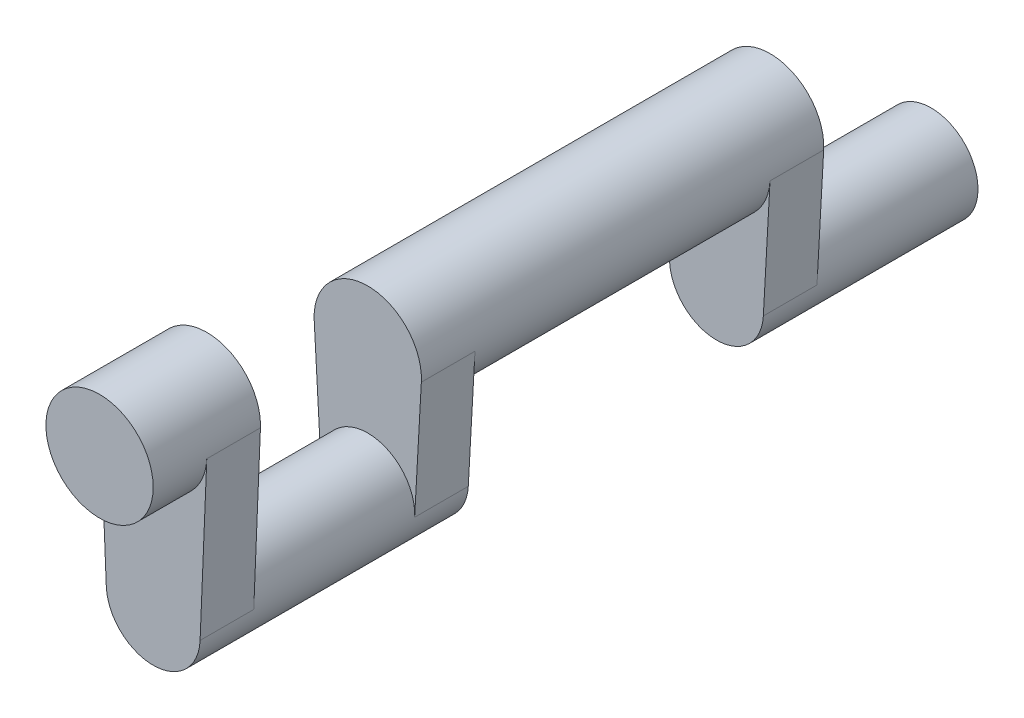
from build123d import *
from build123d.topology import SkipClean

# Parameters (mm, degrees)
SKETCH1_R             = 25.4
EXTRUDE1_DEPTH        = 25.4
LARGE_OFFSET_DEPTH    = 25.4
SKETCH3_R             = 22.225
SHORT_CYLINDER1_DEPTH = 76.2
SMALL_OFFSET1_DEPTH   = 25.4
SKETCH5_R             = 25.4
LONG_CYLINDER_DEPTH   = 190.5
SMALL_START           = -25.4
SMALL_OFFSET2_DEPTH   = 25.4
SKETCH7_R             = 22.225
SHORT_CYLINDER2_DEPTH = 76.2


with BuildPart() as part:
    # Sketch1 → Extrude1 (new body)
    with BuildSketch(Plane.XY):
        Circle(SKETCH1_R)
    extrude(amount=-EXTRUDE1_DEPTH)

    # Sketch2 → large offset (add)
    with SkipClean():  # the faces are left unmerged after this step: merging them gives an invalid solid
        with BuildSketch(Plane(origin=(0, 0, -25.4), x_dir=(-1, 0, 0), z_dir=(0, 0, -1))):
            with BuildLine():
                Line((-25.377941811, -1.058333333), (-22.205699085, -77.126041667))
                ThreePointArc((-22.205699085, -77.126041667), (0, -98.425), (22.205699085, -77.126041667))
                Line((22.205699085, -77.126041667), (25.377941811, -1.058333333))
                ThreePointArc((25.377941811, -1.058333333), (0, 25.4), (-25.377941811, -1.058333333))
            make_face()
        extrude(amount=LARGE_OFFSET_DEPTH)

    # Sketch3 → short cylinder1 (add)
    with SkipClean():  # the faces are left unmerged after this step: merging them gives an invalid solid
        with BuildSketch(Plane(origin=(0, 0, -50.8), x_dir=(-1, 0, 0), z_dir=(0, 0, -1))):
            with Locations(Location((0, -76.2, 0), (0, 0, 182.388015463))):
                Circle(SKETCH3_R)
        extrude(amount=SHORT_CYLINDER1_DEPTH)

    # Sketch4 → small offset1 (add)
    with SkipClean():  # the faces are left unmerged after this step: merging them gives an invalid solid
        with BuildSketch(Plane(origin=(0, 0, -127), x_dir=(-1, 0, 0), z_dir=(0, 0, -1))):
            with BuildLine():
                Line((-22.190675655, -77.434722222), (-25.360772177, -20.461111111))
                ThreePointArc((-25.360772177, -20.461111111), (0, 6.35), (25.360772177, -20.461111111))
                Line((25.360772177, -20.461111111), (22.190675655, -77.434722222))
                ThreePointArc((22.190675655, -77.434722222), (0, -98.425), (-22.190675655, -77.434722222))
            make_face()
        extrude(amount=SMALL_OFFSET1_DEPTH)

    # Sketch5 → long cylinder (add)
    with SkipClean():  # the faces are left unmerged after this step: merging them gives an invalid solid
        with BuildSketch(Plane(origin=(0, 0, -127), x_dir=(-1, 0, 0), z_dir=(0, 0, -1))):
            with Locations(Location((0, -19.05, 0), (0, 0, 183.184738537))):
                Circle(SKETCH5_R)
        extrude(amount=LONG_CYLINDER_DEPTH)

    # Sketch6 → small offset2 (add)
    with SkipClean():  # the faces are left unmerged after this step: merging them gives an invalid solid
        with BuildSketch(Plane(origin=(0, 0, -317.5), x_dir=(-1, 0, 0), z_dir=(0, 0, -1)).offset(SMALL_START)):
            with BuildLine():
                Line((25.360772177, -20.461111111), (22.190675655, -77.434722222))
                ThreePointArc((22.190675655, -77.434722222), (0, -98.425), (-22.190675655, -77.434722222))
                Line((-22.190675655, -77.434722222), (-25.360772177, -20.461111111))
                ThreePointArc((-25.360772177, -20.461111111), (0, 6.35), (25.360772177, -20.461111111))
            make_face()
        extrude(amount=SMALL_OFFSET2_DEPTH)

    # Sketch7 → short cylinder2 (add)
    with SkipClean():  # the faces are left unmerged after this step: merging them gives an invalid solid
        with BuildSketch(Plane.XY.offset(-317.5)):
            with Locations(Location((0, -76.2, 0), (0, 0, 357.611984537))):
                Circle(SKETCH7_R)
        extrude(amount=-SHORT_CYLINDER2_DEPTH)


solid = part.part
